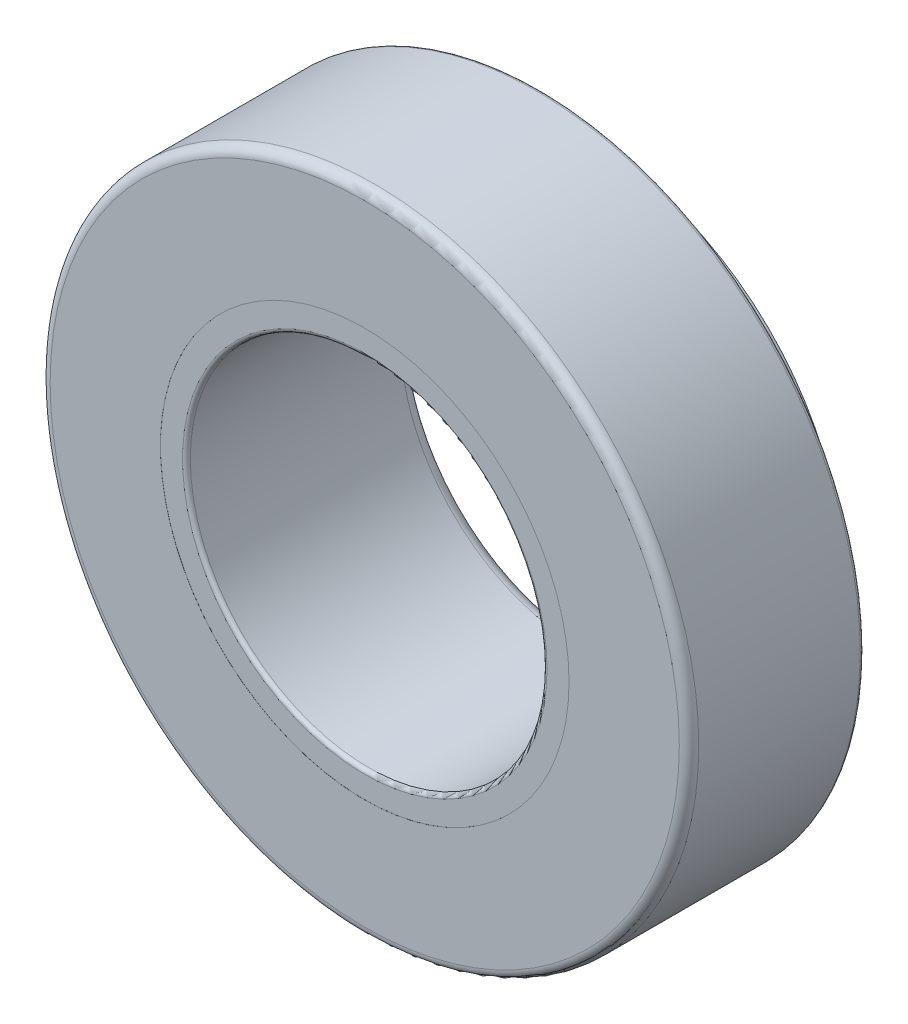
from build123d import *


with BuildPart() as part:
    # E_corps → Corps (revolve)
    with BuildSketch(Plane(origin=(0, 0, 0), x_dir=(0, 0, -1), z_dir=(1, 0, 0)), mode=Mode.PRIVATE) as corps_sk:
        with BuildLine():
            Line((0.61, 27.5), (33, 27.5))
            ThreePointArc((33, 27.5), (34.414213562, 28.085786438), (35, 29.5))
            Line((35, 29.5), (35, 38.8))
            Line((35, 38.8), (31, 38.8))
            Line((31, 38.8), (31, 42.5))
            Line((31, 42.5), (27, 41.725806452))
            Line((27, 41.725806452), (27, 49.4))
            ThreePointArc((27, 49.4), (26.824264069, 49.824264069), (26.4, 50))
            Line((26.4, 50), (1.5, 50))
            ThreePointArc((1.5, 50), (0.439339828, 49.560660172), (0, 48.5))
            Line((0, 48.5), (0, 31.5))
            Line((0, 31.5), (0.01, 31.5))
            Line((0.01, 31.5), (0.01, 28.1))
            ThreePointArc((0.01, 28.1), (0.185735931, 27.675735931), (0.61, 27.5))
        make_face()
    revolve(corps_sk.sketch.rotate(Axis((0, 0, 59.991321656), (0, 0, -1)), 90), axis=Axis((0, 0, 59.991321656), (0, 0, -1)))

    # E_symbole1 → Symbole1 (revolve, cut)
    with BuildSketch(Plane(origin=(0, 0, 0), x_dir=(0, 0, -1), z_dir=(1, 0, 0)), mode=Mode.PRIVATE) as symbole1_sk:
        Polygon((0.028900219, 36.500500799), (0.027, 36.510318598), (26.971099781, 41.725305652), (26.973, 41.715487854), align=None)
    revolve(symbole1_sk.sketch.rotate(Axis((0, 0, 40.122853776), (0, 0, -1)), 90), axis=Axis((0, 0, 40.122853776), (0, 0, -1)), mode=Mode.SUBTRACT)

    # E_sybole2 → Symbole2 (revolve, cut)
    with BuildSketch(Plane(origin=(0, 0, 0), x_dir=(0, 0, -1), z_dir=(1, 0, 0)), mode=Mode.PRIVATE) as symbole2_sk:
        Polygon((24.126063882, 35.450355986), (10.872035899, 32.885060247), (10.873936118, 32.875242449), (24.127964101, 35.440538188), align=None)
    revolve(symbole2_sk.sketch.rotate(Axis((0, 0, 18.896952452), (0, 0, -1)), 90), axis=Axis((0, 0, 18.896952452), (0, 0, -1)), mode=Mode.SUBTRACT)


solid = part.part
